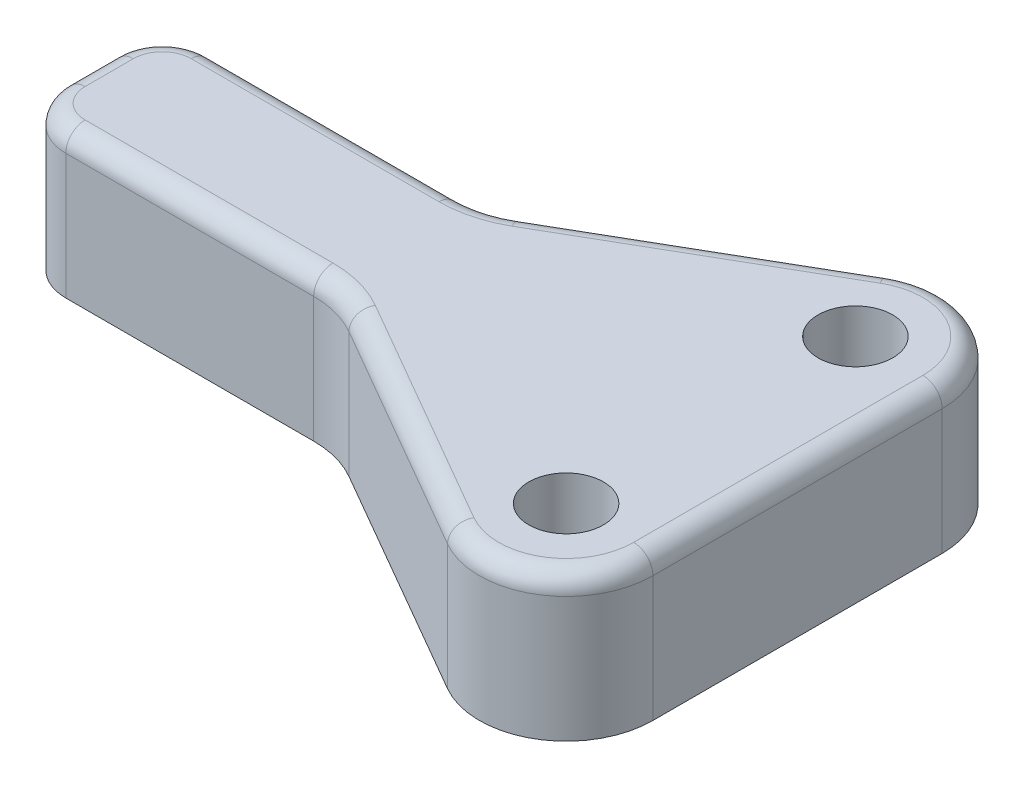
ISO-10303-21;
HEADER;
FILE_DESCRIPTION(('STEP AP214'),'2;1');
FILE_NAME('part.step','',(''),(''),'','','');
FILE_SCHEMA(('AUTOMOTIVE_DESIGN { 1 0 10303 214 1 1 1 1 }'));
ENDSEC;
DATA;
#1=APPLICATION_CONTEXT('core data for automotive mechanical design processes');
#2=APPLICATION_PROTOCOL_DEFINITION('international standard','automotive_design',2000,#1);
#3=PRODUCT_CONTEXT('',#1,'mechanical');
#4=PRODUCT('Part','Part','',(#3));
#5=PRODUCT_RELATED_PRODUCT_CATEGORY('part','',(#4));
#6=PRODUCT_DEFINITION_FORMATION('','',#4);
#7=PRODUCT_DEFINITION_CONTEXT('part definition',#1,'design');
#8=PRODUCT_DEFINITION('design','',#6,#7);
#9=PRODUCT_DEFINITION_SHAPE('','',#8);
#10=(LENGTH_UNIT() NAMED_UNIT(*) SI_UNIT(.MILLI.,.METRE.));
#11=(NAMED_UNIT(*) PLANE_ANGLE_UNIT() SI_UNIT($,.RADIAN.));
#12=(NAMED_UNIT(*) SI_UNIT($,.STERADIAN.) SOLID_ANGLE_UNIT());
#13=UNCERTAINTY_MEASURE_WITH_UNIT(LENGTH_MEASURE(1.E-05),#10,'distance_accuracy_value','');
#14=(GEOMETRIC_REPRESENTATION_CONTEXT(3) GLOBAL_UNCERTAINTY_ASSIGNED_CONTEXT((#13)) GLOBAL_UNIT_ASSIGNED_CONTEXT((#10,
#11,#12)) REPRESENTATION_CONTEXT('',''));
#15=CARTESIAN_POINT('',(0.,0.,0.));
#16=DIRECTION('',(0.,0.,1.));
#17=DIRECTION('',(1.,0.,0.));
#18=AXIS2_PLACEMENT_3D('',#15,#16,#17);
#19=CARTESIAN_POINT('',(40.6369769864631,-9.525,9.525));
#20=DIRECTION('',(0.,1.,0.));
#21=DIRECTION('',(0.,0.,1.));
#22=AXIS2_PLACEMENT_3D('',#19,#20,#21);
#23=CYLINDRICAL_SURFACE('',#22,5.715);
#24=DIRECTION('',(0.,1.,0.));
#25=VECTOR('',#24,1.);
#26=CARTESIAN_POINT('',(46.3519769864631,-9.525,9.525));
#27=LINE('',#26,#25);
#28=CARTESIAN_POINT('',(46.3519769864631,-9.525,9.525));
#29=VERTEX_POINT('',#28);
#30=CARTESIAN_POINT('',(46.3519769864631,-1.27,9.525));
#31=VERTEX_POINT('',#30);
#32=EDGE_CURVE('E241',#29,#31,#27,.T.);
#33=ORIENTED_EDGE('',*,*,#32,.T.);
#34=CARTESIAN_POINT('',(40.6369769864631,-1.27,9.525));
#35=DIRECTION('',(0.,-1.,0.));
#36=DIRECTION('',(0.,0.,-1.));
#37=AXIS2_PLACEMENT_3D('',#34,#35,#36);
#38=CIRCLE('',#37,5.715);
#39=CARTESIAN_POINT('',(37.7802549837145,-1.27,14.4747842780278));
#40=VERTEX_POINT('',#39);
#41=EDGE_CURVE('E316',#31,#40,#38,.T.);
#42=ORIENTED_EDGE('',*,*,#41,.T.);
#43=DIRECTION('',(0.,1.,0.));
#44=VECTOR('',#43,1.);
#45=CARTESIAN_POINT('',(37.7802549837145,-9.525,14.4747842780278));
#46=LINE('',#45,#44);
#47=CARTESIAN_POINT('',(37.7802549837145,-9.525,14.4747842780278));
#48=VERTEX_POINT('',#47);
#49=EDGE_CURVE('E242',#48,#40,#46,.T.);
#50=ORIENTED_EDGE('',*,*,#49,.F.);
#51=CARTESIAN_POINT('',(40.6369769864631,-9.525,9.525));
#52=DIRECTION('',(0.,1.,0.));
#53=DIRECTION('',(0.,0.,-1.));
#54=AXIS2_PLACEMENT_3D('',#51,#52,#53);
#55=CIRCLE('',#54,5.715);
#56=EDGE_CURVE('E205',#48,#29,#55,.T.);
#57=ORIENTED_EDGE('',*,*,#56,.T.);
#58=EDGE_LOOP('',(#33,#42,#50,#57));
#59=FACE_BOUND('',#58,.T.);
#60=ADVANCED_FACE('F51',(#59),#23,.T.);
#61=CARTESIAN_POINT('',(37.7802549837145,-9.525,14.4747842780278));
#62=DIRECTION('',(-0.49986386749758,0.,0.866103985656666));
#63=DIRECTION('',(0.866103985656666,0.,0.49986386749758));
#64=AXIS2_PLACEMENT_3D('',#61,#62,#63);
#65=PLANE('',#64);
#66=ORIENTED_EDGE('',*,*,#49,.T.);
#67=DIRECTION('',(0.866103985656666,0.,0.49986386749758));
#68=VECTOR('',#67,1.);
#69=CARTESIAN_POINT('',(22.4251700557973,-1.27,5.61273969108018));
#70=LINE('',#69,#68);
#71=CARTESIAN_POINT('',(22.4251700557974,-1.27,5.61273969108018));
#72=VERTEX_POINT('',#71);
#73=EDGE_CURVE('E75',#40,#72,#70,.F.);
#74=ORIENTED_EDGE('',*,*,#73,.T.);
#75=DIRECTION('',(0.,1.,0.));
#76=VECTOR('',#75,1.);
#77=CARTESIAN_POINT('',(22.4251700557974,-9.525,5.61273969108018));
#78=LINE('',#77,#76);
#79=CARTESIAN_POINT('',(22.4251700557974,-9.525,5.61273969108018));
#80=VERTEX_POINT('',#79);
#81=EDGE_CURVE('E245',#80,#72,#78,.T.);
#82=ORIENTED_EDGE('',*,*,#81,.F.);
#83=DIRECTION('',(0.866103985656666,0.,0.49986386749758));
#84=VECTOR('',#83,1.);
#85=CARTESIAN_POINT('',(37.7802549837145,-9.525,14.4747842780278));
#86=LINE('',#85,#84);
#87=EDGE_CURVE('E238',#80,#48,#86,.T.);
#88=ORIENTED_EDGE('',*,*,#87,.T.);
#89=EDGE_LOOP('',(#66,#74,#82,#88));
#90=FACE_BOUND('',#89,.T.);
#91=ADVANCED_FACE('F378',(#90),#65,.T.);
#92=CARTESIAN_POINT('',(19.2510344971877,-9.525,11.1125));
#93=DIRECTION('',(0.,1.,0.));
#94=DIRECTION('',(0.,0.,1.));
#95=AXIS2_PLACEMENT_3D('',#92,#93,#94);
#96=CYLINDRICAL_SURFACE('',#95,6.35);
#97=ORIENTED_EDGE('',*,*,#81,.T.);
#98=CARTESIAN_POINT('',(19.2510344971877,-1.27,11.1125));
#99=DIRECTION('',(0.,-1.,0.));
#100=DIRECTION('',(0.,0.,-1.));
#101=AXIS2_PLACEMENT_3D('',#98,#99,#100);
#102=CIRCLE('',#101,6.35);
#103=CARTESIAN_POINT('',(19.2510344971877,-1.27,4.76250000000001));
#104=VERTEX_POINT('',#103);
#105=EDGE_CURVE('E60',#72,#104,#102,.F.);
#106=ORIENTED_EDGE('',*,*,#105,.T.);
#107=DIRECTION('',(0.,1.,0.));
#108=VECTOR('',#107,1.);
#109=CARTESIAN_POINT('',(19.2510344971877,-9.525,4.76250000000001));
#110=LINE('',#109,#108);
#111=CARTESIAN_POINT('',(19.2510344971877,-9.525,4.76250000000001));
#112=VERTEX_POINT('',#111);
#113=EDGE_CURVE('E247',#112,#104,#110,.T.);
#114=ORIENTED_EDGE('',*,*,#113,.F.);
#115=CARTESIAN_POINT('',(19.2510344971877,-9.525,11.1125));
#116=DIRECTION('',(0.,-1.,0.));
#117=DIRECTION('',(0.,0.,1.));
#118=AXIS2_PLACEMENT_3D('',#115,#116,#117);
#119=CIRCLE('',#118,6.35);
#120=EDGE_CURVE('E235',#112,#80,#119,.T.);
#121=ORIENTED_EDGE('',*,*,#120,.T.);
#122=EDGE_LOOP('',(#97,#106,#114,#121));
#123=FACE_BOUND('',#122,.T.);
#124=ADVANCED_FACE('F453',(#123),#96,.F.);
#125=CARTESIAN_POINT('',(19.2510344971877,-9.525,4.76250000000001));
#126=DIRECTION('',(0.,0.,1.));
#127=DIRECTION('',(1.,0.,0.));
#128=AXIS2_PLACEMENT_3D('',#125,#126,#127);
#129=PLANE('',#128);
#130=ORIENTED_EDGE('',*,*,#113,.T.);
#131=DIRECTION('',(1.,0.,0.));
#132=VECTOR('',#131,1.);
#133=CARTESIAN_POINT('',(2.93013120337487,-1.27,4.76250000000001));
#134=LINE('',#133,#132);
#135=CARTESIAN_POINT('',(2.93013120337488,-1.27,4.76250000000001));
#136=VERTEX_POINT('',#135);
#137=EDGE_CURVE('E13',#104,#136,#134,.F.);
#138=ORIENTED_EDGE('',*,*,#137,.T.);
#139=DIRECTION('',(0.,1.,0.));
#140=VECTOR('',#139,1.);
#141=CARTESIAN_POINT('',(2.93013120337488,-9.525,4.76250000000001));
#142=LINE('',#141,#140);
#143=CARTESIAN_POINT('',(2.93013120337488,-9.525,4.76250000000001));
#144=VERTEX_POINT('',#143);
#145=EDGE_CURVE('E249',#144,#136,#142,.T.);
#146=ORIENTED_EDGE('',*,*,#145,.F.);
#147=DIRECTION('',(1.,0.,0.));
#148=VECTOR('',#147,1.);
#149=CARTESIAN_POINT('',(19.2510344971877,-9.525,4.76250000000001));
#150=LINE('',#149,#148);
#151=EDGE_CURVE('E232',#144,#112,#150,.T.);
#152=ORIENTED_EDGE('',*,*,#151,.T.);
#153=EDGE_LOOP('',(#130,#138,#146,#152));
#154=FACE_BOUND('',#153,.T.);
#155=ADVANCED_FACE('F396',(#154),#129,.T.);
#156=CARTESIAN_POINT('',(2.93013120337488,-9.525,1.58750000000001));
#157=DIRECTION('',(0.,1.,0.));
#158=DIRECTION('',(0.,0.,1.));
#159=AXIS2_PLACEMENT_3D('',#156,#157,#158);
#160=CYLINDRICAL_SURFACE('',#159,3.175);
#161=ORIENTED_EDGE('',*,*,#145,.T.);
#162=CARTESIAN_POINT('',(2.93013120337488,-1.27,1.58750000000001));
#163=DIRECTION('',(0.,-1.,0.));
#164=DIRECTION('',(0.,0.,-1.));
#165=AXIS2_PLACEMENT_3D('',#162,#163,#164);
#166=CIRCLE('',#165,3.175);
#167=CARTESIAN_POINT('',(-0.244868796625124,-1.27,1.58750000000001));
#168=VERTEX_POINT('',#167);
#169=EDGE_CURVE('E299',#136,#168,#166,.T.);
#170=ORIENTED_EDGE('',*,*,#169,.T.);
#171=DIRECTION('',(0.,1.,0.));
#172=VECTOR('',#171,1.);
#173=CARTESIAN_POINT('',(-0.244868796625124,-9.525,1.58750000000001));
#174=LINE('',#173,#172);
#175=CARTESIAN_POINT('',(-0.244868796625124,-9.525,1.58750000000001));
#176=VERTEX_POINT('',#175);
#177=EDGE_CURVE('E252',#176,#168,#174,.T.);
#178=ORIENTED_EDGE('',*,*,#177,.F.);
#179=CARTESIAN_POINT('',(2.93013120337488,-9.525,1.58750000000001));
#180=DIRECTION('',(0.,1.,0.));
#181=DIRECTION('',(0.,0.,-1.));
#182=AXIS2_PLACEMENT_3D('',#179,#180,#181);
#183=CIRCLE('',#182,3.175);
#184=EDGE_CURVE('E229',#176,#144,#183,.T.);
#185=ORIENTED_EDGE('',*,*,#184,.T.);
#186=EDGE_LOOP('',(#161,#170,#178,#185));
#187=FACE_BOUND('',#186,.T.);
#188=ADVANCED_FACE('F400',(#187),#160,.T.);
#189=CARTESIAN_POINT('',(-0.244868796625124,-9.525,1.58750000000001));
#190=DIRECTION('',(-1.,0.,0.));
#191=DIRECTION('',(0.,0.,1.));
#192=AXIS2_PLACEMENT_3D('',#189,#190,#191);
#193=PLANE('',#192);
#194=CARTESIAN_POINT('',(-0.244868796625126,-6.985,0.));
#195=DIRECTION('',(-1.,0.,0.));
#196=DIRECTION('',(0.,0.,1.));
#197=AXIS2_PLACEMENT_3D('',#194,#195,#196);
#198=CIRCLE('',#197,1.13029999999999);
#199=CARTESIAN_POINT('',(-0.244868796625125,-6.985,1.13029999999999));
#200=VERTEX_POINT('',#199);
#201=EDGE_CURVE('E189',#200,#200,#198,.T.);
#202=ORIENTED_EDGE('',*,*,#201,.F.);
#203=EDGE_LOOP('',(#202));
#204=FACE_BOUND('',#203,.T.);
#205=ORIENTED_EDGE('',*,*,#177,.T.);
#206=DIRECTION('',(0.,0.,1.));
#207=VECTOR('',#206,1.);
#208=CARTESIAN_POINT('',(-0.244868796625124,-1.27,-1.58749999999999));
#209=LINE('',#208,#207);
#210=CARTESIAN_POINT('',(-0.244868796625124,-1.27,-1.58749999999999));
#211=VERTEX_POINT('',#210);
#212=EDGE_CURVE('E302',#168,#211,#209,.F.);
#213=ORIENTED_EDGE('',*,*,#212,.T.);
#214=DIRECTION('',(0.,1.,0.));
#215=VECTOR('',#214,1.);
#216=CARTESIAN_POINT('',(-0.244868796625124,-9.525,-1.58749999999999));
#217=LINE('',#216,#215);
#218=CARTESIAN_POINT('',(-0.244868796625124,-9.525,-1.58749999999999));
#219=VERTEX_POINT('',#218);
#220=EDGE_CURVE('E255',#219,#211,#217,.T.);
#221=ORIENTED_EDGE('',*,*,#220,.F.);
#222=DIRECTION('',(0.,0.,1.));
#223=VECTOR('',#222,1.);
#224=CARTESIAN_POINT('',(-0.244868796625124,-9.525,1.58750000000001));
#225=LINE('',#224,#223);
#226=EDGE_CURVE('E226',#219,#176,#225,.T.);
#227=ORIENTED_EDGE('',*,*,#226,.T.);
#228=EDGE_LOOP('',(#205,#213,#221,#227));
#229=FACE_BOUND('',#228,.T.);
#230=ADVANCED_FACE('F412',(#204,#229),#193,.T.);
#231=CARTESIAN_POINT('',(2.93013120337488,-9.525,-1.58749999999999));
#232=DIRECTION('',(0.,1.,0.));
#233=DIRECTION('',(0.,0.,1.));
#234=AXIS2_PLACEMENT_3D('',#231,#232,#233);
#235=CYLINDRICAL_SURFACE('',#234,3.175);
#236=ORIENTED_EDGE('',*,*,#220,.T.);
#237=CARTESIAN_POINT('',(2.93013120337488,-1.27,-1.58749999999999));
#238=DIRECTION('',(0.,-1.,0.));
#239=DIRECTION('',(0.,0.,-1.));
#240=AXIS2_PLACEMENT_3D('',#237,#238,#239);
#241=CIRCLE('',#240,3.175);
#242=CARTESIAN_POINT('',(2.93013120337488,-1.27,-4.76249999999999));
#243=VERTEX_POINT('',#242);
#244=EDGE_CURVE('E304',#211,#243,#241,.T.);
#245=ORIENTED_EDGE('',*,*,#244,.T.);
#246=DIRECTION('',(0.,1.,0.));
#247=VECTOR('',#246,1.);
#248=CARTESIAN_POINT('',(2.93013120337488,-9.525,-4.76249999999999));
#249=LINE('',#248,#247);
#250=CARTESIAN_POINT('',(2.93013120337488,-9.525,-4.76249999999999));
#251=VERTEX_POINT('',#250);
#252=EDGE_CURVE('E258',#251,#243,#249,.T.);
#253=ORIENTED_EDGE('',*,*,#252,.F.);
#254=CARTESIAN_POINT('',(2.93013120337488,-9.525,-1.58749999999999));
#255=DIRECTION('',(0.,1.,0.));
#256=DIRECTION('',(0.,0.,1.));
#257=AXIS2_PLACEMENT_3D('',#254,#255,#256);
#258=CIRCLE('',#257,3.175);
#259=EDGE_CURVE('E223',#251,#219,#258,.T.);
#260=ORIENTED_EDGE('',*,*,#259,.T.);
#261=EDGE_LOOP('',(#236,#245,#253,#260));
#262=FACE_BOUND('',#261,.T.);
#263=ADVANCED_FACE('F416',(#262),#235,.T.);
#264=CARTESIAN_POINT('',(19.2510344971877,-9.525,-4.76249999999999));
#265=DIRECTION('',(0.,0.,-1.));
#266=DIRECTION('',(-1.,0.,0.));
#267=AXIS2_PLACEMENT_3D('',#264,#265,#266);
#268=PLANE('',#267);
#269=ORIENTED_EDGE('',*,*,#252,.T.);
#270=DIRECTION('',(-1.,0.,0.));
#271=VECTOR('',#270,1.);
#272=CARTESIAN_POINT('',(19.2510344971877,-1.27,-4.76249999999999));
#273=LINE('',#272,#271);
#274=CARTESIAN_POINT('',(19.2510344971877,-1.27,-4.76249999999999));
#275=VERTEX_POINT('',#274);
#276=EDGE_CURVE('E306',#243,#275,#273,.F.);
#277=ORIENTED_EDGE('',*,*,#276,.T.);
#278=DIRECTION('',(0.,1.,0.));
#279=VECTOR('',#278,1.);
#280=CARTESIAN_POINT('',(19.2510344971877,-9.525,-4.76249999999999));
#281=LINE('',#280,#279);
#282=CARTESIAN_POINT('',(19.2510344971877,-9.525,-4.76249999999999));
#283=VERTEX_POINT('',#282);
#284=EDGE_CURVE('E261',#283,#275,#281,.T.);
#285=ORIENTED_EDGE('',*,*,#284,.F.);
#286=DIRECTION('',(-1.,0.,0.));
#287=VECTOR('',#286,1.);
#288=CARTESIAN_POINT('',(19.2510344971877,-9.525,-4.76249999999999));
#289=LINE('',#288,#287);
#290=EDGE_CURVE('E220',#283,#251,#289,.T.);
#291=ORIENTED_EDGE('',*,*,#290,.T.);
#292=EDGE_LOOP('',(#269,#277,#285,#291));
#293=FACE_BOUND('',#292,.T.);
#294=ADVANCED_FACE('F428',(#293),#268,.T.);
#295=CARTESIAN_POINT('',(19.2510344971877,-9.525,-11.1125));
#296=DIRECTION('',(0.,1.,0.));
#297=DIRECTION('',(0.,0.,1.));
#298=AXIS2_PLACEMENT_3D('',#295,#296,#297);
#299=CYLINDRICAL_SURFACE('',#298,6.35);
#300=ORIENTED_EDGE('',*,*,#284,.T.);
#301=CARTESIAN_POINT('',(19.2510344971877,-1.27,-11.1125));
#302=DIRECTION('',(0.,-1.,0.));
#303=DIRECTION('',(0.,0.,-1.));
#304=AXIS2_PLACEMENT_3D('',#301,#302,#303);
#305=CIRCLE('',#304,6.35);
#306=CARTESIAN_POINT('',(22.4251700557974,-1.27,-5.61273969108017));
#307=VERTEX_POINT('',#306);
#308=EDGE_CURVE('E308',#275,#307,#305,.F.);
#309=ORIENTED_EDGE('',*,*,#308,.T.);
#310=DIRECTION('',(0.,1.,0.));
#311=VECTOR('',#310,1.);
#312=CARTESIAN_POINT('',(22.4251700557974,-9.525,-5.61273969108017));
#313=LINE('',#312,#311);
#314=CARTESIAN_POINT('',(22.4251700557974,-9.525,-5.61273969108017));
#315=VERTEX_POINT('',#314);
#316=EDGE_CURVE('E264',#315,#307,#313,.T.);
#317=ORIENTED_EDGE('',*,*,#316,.F.);
#318=CARTESIAN_POINT('',(19.2510344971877,-9.525,-11.1125));
#319=DIRECTION('',(0.,-1.,0.));
#320=DIRECTION('',(0.,0.,-1.));
#321=AXIS2_PLACEMENT_3D('',#318,#319,#320);
#322=CIRCLE('',#321,6.35);
#323=EDGE_CURVE('E217',#315,#283,#322,.T.);
#324=ORIENTED_EDGE('',*,*,#323,.T.);
#325=EDGE_LOOP('',(#300,#309,#317,#324));
#326=FACE_BOUND('',#325,.T.);
#327=ADVANCED_FACE('F432',(#326),#299,.F.);
#328=CARTESIAN_POINT('',(37.7802549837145,-9.525,-14.4747842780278));
#329=DIRECTION('',(-0.49986386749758,0.,-0.866103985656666));
#330=DIRECTION('',(-0.866103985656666,0.,0.49986386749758));
#331=AXIS2_PLACEMENT_3D('',#328,#329,#330);
#332=PLANE('',#331);
#333=ORIENTED_EDGE('',*,*,#316,.T.);
#334=DIRECTION('',(-0.866103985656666,0.,0.49986386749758));
#335=VECTOR('',#334,1.);
#336=CARTESIAN_POINT('',(37.7802549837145,-1.27,-14.4747842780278));
#337=LINE('',#336,#335);
#338=CARTESIAN_POINT('',(37.7802549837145,-1.27,-14.4747842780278));
#339=VERTEX_POINT('',#338);
#340=EDGE_CURVE('E310',#307,#339,#337,.F.);
#341=ORIENTED_EDGE('',*,*,#340,.T.);
#342=DIRECTION('',(0.,1.,0.));
#343=VECTOR('',#342,1.);
#344=CARTESIAN_POINT('',(37.7802549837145,-9.525,-14.4747842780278));
#345=LINE('',#344,#343);
#346=CARTESIAN_POINT('',(37.7802549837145,-9.525,-14.4747842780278));
#347=VERTEX_POINT('',#346);
#348=EDGE_CURVE('E267',#347,#339,#345,.T.);
#349=ORIENTED_EDGE('',*,*,#348,.F.);
#350=DIRECTION('',(-0.866103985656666,0.,0.49986386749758));
#351=VECTOR('',#350,1.);
#352=CARTESIAN_POINT('',(37.7802549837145,-9.525,-14.4747842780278));
#353=LINE('',#352,#351);
#354=EDGE_CURVE('E214',#347,#315,#353,.T.);
#355=ORIENTED_EDGE('',*,*,#354,.T.);
#356=EDGE_LOOP('',(#333,#341,#349,#355));
#357=FACE_BOUND('',#356,.T.);
#358=ADVANCED_FACE('F599',(#357),#332,.T.);
#359=CARTESIAN_POINT('',(40.6369769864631,-9.525,-9.525));
#360=DIRECTION('',(0.,1.,0.));
#361=DIRECTION('',(0.,0.,1.));
#362=AXIS2_PLACEMENT_3D('',#359,#360,#361);
#363=CYLINDRICAL_SURFACE('',#362,5.71499999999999);
#364=ORIENTED_EDGE('',*,*,#348,.T.);
#365=CARTESIAN_POINT('',(40.6369769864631,-1.27,-9.525));
#366=DIRECTION('',(0.,-1.,0.));
#367=DIRECTION('',(0.,0.,-1.));
#368=AXIS2_PLACEMENT_3D('',#365,#366,#367);
#369=CIRCLE('',#368,5.71499999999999);
#370=CARTESIAN_POINT('',(46.3519769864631,-1.27,-9.52499999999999));
#371=VERTEX_POINT('',#370);
#372=EDGE_CURVE('E312',#339,#371,#369,.T.);
#373=ORIENTED_EDGE('',*,*,#372,.T.);
#374=DIRECTION('',(0.,1.,0.));
#375=VECTOR('',#374,1.);
#376=CARTESIAN_POINT('',(46.3519769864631,-9.525,-9.52499999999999));
#377=LINE('',#376,#375);
#378=CARTESIAN_POINT('',(46.3519769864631,-9.525,-9.52499999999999));
#379=VERTEX_POINT('',#378);
#380=EDGE_CURVE('E270',#379,#371,#377,.T.);
#381=ORIENTED_EDGE('',*,*,#380,.F.);
#382=CARTESIAN_POINT('',(40.6369769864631,-9.525,-9.525));
#383=DIRECTION('',(0.,1.,0.));
#384=DIRECTION('',(0.,0.,1.));
#385=AXIS2_PLACEMENT_3D('',#382,#383,#384);
#386=CIRCLE('',#385,5.71499999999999);
#387=EDGE_CURVE('E211',#379,#347,#386,.T.);
#388=ORIENTED_EDGE('',*,*,#387,.T.);
#389=EDGE_LOOP('',(#364,#373,#381,#388));
#390=FACE_BOUND('',#389,.T.);
#391=ADVANCED_FACE('F364',(#390),#363,.T.);
#392=CARTESIAN_POINT('',(46.3519769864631,-9.525,-9.52499999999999));
#393=DIRECTION('',(1.,0.,0.));
#394=DIRECTION('',(0.,0.,-1.));
#395=AXIS2_PLACEMENT_3D('',#392,#393,#394);
#396=PLANE('',#395);
#397=ORIENTED_EDGE('',*,*,#380,.T.);
#398=DIRECTION('',(0.,0.,-1.));
#399=VECTOR('',#398,1.);
#400=CARTESIAN_POINT('',(46.3519769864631,-1.27,9.525));
#401=LINE('',#400,#399);
#402=EDGE_CURVE('E314',#371,#31,#401,.F.);
#403=ORIENTED_EDGE('',*,*,#402,.T.);
#404=ORIENTED_EDGE('',*,*,#32,.F.);
#405=DIRECTION('',(0.,0.,-1.));
#406=VECTOR('',#405,1.);
#407=CARTESIAN_POINT('',(46.3519769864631,-9.525,-9.52499999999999));
#408=LINE('',#407,#406);
#409=EDGE_CURVE('E208',#29,#379,#408,.T.);
#410=ORIENTED_EDGE('',*,*,#409,.T.);
#411=EDGE_LOOP('',(#397,#403,#404,#410));
#412=FACE_BOUND('',#411,.T.);
#413=ADVANCED_FACE('F367',(#412),#396,.T.);
#414=CARTESIAN_POINT('',(40.6369769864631,-9.525,9.525));
#415=DIRECTION('',(0.,-1.,0.));
#416=DIRECTION('',(0.,0.,-1.));
#417=AXIS2_PLACEMENT_3D('',#414,#415,#416);
#418=PLANE('',#417);
#419=CARTESIAN_POINT('',(40.6369769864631,-9.525,9.525));
#420=DIRECTION('',(0.,1.,0.));
#421=DIRECTION('',(0.,0.,1.));
#422=AXIS2_PLACEMENT_3D('',#419,#420,#421);
#423=CIRCLE('',#422,2.45745);
#424=CARTESIAN_POINT('',(40.6369769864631,-9.525,11.98245));
#425=VERTEX_POINT('',#424);
#426=EDGE_CURVE('E192',#425,#425,#423,.T.);
#427=ORIENTED_EDGE('',*,*,#426,.T.);
#428=EDGE_LOOP('',(#427));
#429=FACE_BOUND('',#428,.T.);
#430=CARTESIAN_POINT('',(40.6369769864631,-9.525,-9.525));
#431=DIRECTION('',(0.,1.,0.));
#432=DIRECTION('',(0.,0.,1.));
#433=AXIS2_PLACEMENT_3D('',#430,#431,#432);
#434=CIRCLE('',#433,2.45745);
#435=CARTESIAN_POINT('',(40.6369769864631,-9.525,-7.06755));
#436=VERTEX_POINT('',#435);
#437=EDGE_CURVE('E202',#436,#436,#434,.T.);
#438=ORIENTED_EDGE('',*,*,#437,.T.);
#439=EDGE_LOOP('',(#438));
#440=FACE_BOUND('',#439,.T.);
#441=ORIENTED_EDGE('',*,*,#56,.F.);
#442=ORIENTED_EDGE('',*,*,#87,.F.);
#443=ORIENTED_EDGE('',*,*,#120,.F.);
#444=ORIENTED_EDGE('',*,*,#151,.F.);
#445=ORIENTED_EDGE('',*,*,#184,.F.);
#446=ORIENTED_EDGE('',*,*,#226,.F.);
#447=ORIENTED_EDGE('',*,*,#259,.F.);
#448=ORIENTED_EDGE('',*,*,#290,.F.);
#449=ORIENTED_EDGE('',*,*,#323,.F.);
#450=ORIENTED_EDGE('',*,*,#354,.F.);
#451=ORIENTED_EDGE('',*,*,#387,.F.);
#452=ORIENTED_EDGE('',*,*,#409,.F.);
#453=EDGE_LOOP('',(#441,#442,#443,#444,#445,#446,#447,#448,#449,#450,#451,#452));
#454=FACE_BOUND('',#453,.T.);
#455=ADVANCED_FACE('F371',(#429,#440,#454),#418,.T.);
#456=CARTESIAN_POINT('',(40.6369769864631,0.,9.525));
#457=DIRECTION('',(0.,-1.,0.));
#458=DIRECTION('',(0.,0.,-1.));
#459=AXIS2_PLACEMENT_3D('',#456,#457,#458);
#460=PLANE('',#459);
#461=DIRECTION('',(0.,0.,1.));
#462=VECTOR('',#461,1.);
#463=CARTESIAN_POINT('',(1.02513120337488,0.,1.58750000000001));
#464=LINE('',#463,#462);
#465=CARTESIAN_POINT('',(1.02513120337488,0.,-1.58749999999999));
#466=VERTEX_POINT('',#465);
#467=CARTESIAN_POINT('',(1.02513120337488,0.,1.58750000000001));
#468=VERTEX_POINT('',#467);
#469=EDGE_CURVE('E294',#466,#468,#464,.T.);
#470=ORIENTED_EDGE('',*,*,#469,.T.);
#471=CARTESIAN_POINT('',(2.93013120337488,0.,1.58750000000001));
#472=DIRECTION('',(0.,-1.,0.));
#473=DIRECTION('',(0.,0.,-1.));
#474=AXIS2_PLACEMENT_3D('',#471,#472,#473);
#475=CIRCLE('',#474,1.905);
#476=CARTESIAN_POINT('',(2.93013120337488,0.,3.49250000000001));
#477=VERTEX_POINT('',#476);
#478=EDGE_CURVE('E296',#468,#477,#475,.F.);
#479=ORIENTED_EDGE('',*,*,#478,.T.);
#480=DIRECTION('',(1.,0.,0.));
#481=VECTOR('',#480,1.);
#482=CARTESIAN_POINT('',(19.2510344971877,0.,3.49250000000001));
#483=LINE('',#482,#481);
#484=CARTESIAN_POINT('',(19.2510344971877,0.,3.49250000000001));
#485=VERTEX_POINT('',#484);
#486=EDGE_CURVE('E244',#477,#485,#483,.T.);
#487=ORIENTED_EDGE('',*,*,#486,.T.);
#488=CARTESIAN_POINT('',(19.2510344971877,0.,11.1125));
#489=DIRECTION('',(0.,-1.,0.));
#490=DIRECTION('',(0.,0.,-1.));
#491=AXIS2_PLACEMENT_3D('',#488,#489,#490);
#492=CIRCLE('',#491,7.62);
#493=CARTESIAN_POINT('',(23.0599971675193,0.,4.51278762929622));
#494=VERTEX_POINT('',#493);
#495=EDGE_CURVE('E276',#485,#494,#492,.T.);
#496=ORIENTED_EDGE('',*,*,#495,.T.);
#497=DIRECTION('',(0.866103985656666,0.,0.49986386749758));
#498=VECTOR('',#497,1.);
#499=CARTESIAN_POINT('',(38.4150820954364,0.,13.3748322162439));
#500=LINE('',#499,#498);
#501=CARTESIAN_POINT('',(38.4150820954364,0.,13.3748322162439));
#502=VERTEX_POINT('',#501);
#503=EDGE_CURVE('E278',#494,#502,#500,.T.);
#504=ORIENTED_EDGE('',*,*,#503,.T.);
#505=CARTESIAN_POINT('',(40.6369769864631,0.,9.525));
#506=DIRECTION('',(0.,-1.,0.));
#507=DIRECTION('',(0.,0.,-1.));
#508=AXIS2_PLACEMENT_3D('',#505,#506,#507);
#509=CIRCLE('',#508,4.445);
#510=CARTESIAN_POINT('',(45.0819769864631,0.,9.525));
#511=VERTEX_POINT('',#510);
#512=EDGE_CURVE('E280',#502,#511,#509,.F.);
#513=ORIENTED_EDGE('',*,*,#512,.T.);
#514=DIRECTION('',(0.,0.,-1.));
#515=VECTOR('',#514,1.);
#516=CARTESIAN_POINT('',(45.0819769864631,0.,-9.52499999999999));
#517=LINE('',#516,#515);
#518=CARTESIAN_POINT('',(45.0819769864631,0.,-9.52499999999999));
#519=VERTEX_POINT('',#518);
#520=EDGE_CURVE('E282',#511,#519,#517,.T.);
#521=ORIENTED_EDGE('',*,*,#520,.T.);
#522=CARTESIAN_POINT('',(40.6369769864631,0.,-9.525));
#523=DIRECTION('',(0.,-1.,0.));
#524=DIRECTION('',(0.,0.,-1.));
#525=AXIS2_PLACEMENT_3D('',#522,#523,#524);
#526=CIRCLE('',#525,4.44499999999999);
#527=CARTESIAN_POINT('',(38.4150820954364,0.,-13.3748322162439));
#528=VERTEX_POINT('',#527);
#529=EDGE_CURVE('E284',#519,#528,#526,.F.);
#530=ORIENTED_EDGE('',*,*,#529,.T.);
#531=DIRECTION('',(-0.866103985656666,0.,0.49986386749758));
#532=VECTOR('',#531,1.);
#533=CARTESIAN_POINT('',(23.0599971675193,0.,-4.5127876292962));
#534=LINE('',#533,#532);
#535=CARTESIAN_POINT('',(23.0599971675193,0.,-4.5127876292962));
#536=VERTEX_POINT('',#535);
#537=EDGE_CURVE('E286',#528,#536,#534,.T.);
#538=ORIENTED_EDGE('',*,*,#537,.T.);
#539=CARTESIAN_POINT('',(19.2510344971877,0.,-11.1125));
#540=DIRECTION('',(0.,-1.,0.));
#541=DIRECTION('',(0.,0.,-1.));
#542=AXIS2_PLACEMENT_3D('',#539,#540,#541);
#543=CIRCLE('',#542,7.62);
#544=CARTESIAN_POINT('',(19.2510344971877,0.,-3.49249999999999));
#545=VERTEX_POINT('',#544);
#546=EDGE_CURVE('E288',#536,#545,#543,.T.);
#547=ORIENTED_EDGE('',*,*,#546,.T.);
#548=DIRECTION('',(-1.,0.,0.));
#549=VECTOR('',#548,1.);
#550=CARTESIAN_POINT('',(2.93013120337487,0.,-3.49249999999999));
#551=LINE('',#550,#549);
#552=CARTESIAN_POINT('',(2.93013120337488,0.,-3.49249999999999));
#553=VERTEX_POINT('',#552);
#554=EDGE_CURVE('E290',#545,#553,#551,.T.);
#555=ORIENTED_EDGE('',*,*,#554,.T.);
#556=CARTESIAN_POINT('',(2.93013120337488,0.,-1.58749999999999));
#557=DIRECTION('',(0.,-1.,0.));
#558=DIRECTION('',(0.,0.,-1.));
#559=AXIS2_PLACEMENT_3D('',#556,#557,#558);
#560=CIRCLE('',#559,1.905);
#561=EDGE_CURVE('E292',#553,#466,#560,.F.);
#562=ORIENTED_EDGE('',*,*,#561,.T.);
#563=EDGE_LOOP('',(#470,#479,#487,#496,#504,#513,#521,#530,#538,#547,#555,#562));
#564=FACE_BOUND('',#563,.T.);
#565=CARTESIAN_POINT('',(40.6369769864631,0.,9.525));
#566=DIRECTION('',(0.,1.,0.));
#567=DIRECTION('',(0.,0.,1.));
#568=AXIS2_PLACEMENT_3D('',#565,#566,#567);
#569=CIRCLE('',#568,2.45745);
#570=CARTESIAN_POINT('',(40.6369769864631,0.,11.98245));
#571=VERTEX_POINT('',#570);
#572=EDGE_CURVE('E188',#571,#571,#569,.T.);
#573=ORIENTED_EDGE('',*,*,#572,.F.);
#574=EDGE_LOOP('',(#573));
#575=FACE_BOUND('',#574,.T.);
#576=CARTESIAN_POINT('',(40.6369769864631,0.,-9.525));
#577=DIRECTION('',(0.,1.,0.));
#578=DIRECTION('',(0.,0.,1.));
#579=AXIS2_PLACEMENT_3D('',#576,#577,#578);
#580=CIRCLE('',#579,2.45745);
#581=CARTESIAN_POINT('',(40.6369769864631,0.,-7.06755));
#582=VERTEX_POINT('',#581);
#583=EDGE_CURVE('E199',#582,#582,#580,.T.);
#584=ORIENTED_EDGE('',*,*,#583,.F.);
#585=EDGE_LOOP('',(#584));
#586=FACE_BOUND('',#585,.T.);
#587=ADVANCED_FACE('F438',(#564,#575,#586),#460,.F.);
#588=CARTESIAN_POINT('',(40.6369769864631,0.,-9.525));
#589=DIRECTION('',(0.,1.,0.));
#590=DIRECTION('',(0.,0.,1.));
#591=AXIS2_PLACEMENT_3D('',#588,#589,#590);
#592=CYLINDRICAL_SURFACE('',#591,2.45745);
#593=ORIENTED_EDGE('',*,*,#437,.F.);
#594=EDGE_LOOP('',(#593));
#595=FACE_BOUND('',#594,.T.);
#596=ORIENTED_EDGE('',*,*,#583,.T.);
#597=EDGE_LOOP('',(#596));
#598=FACE_BOUND('',#597,.T.);
#599=ADVANCED_FACE('F562',(#595,#598),#592,.F.);
#600=CARTESIAN_POINT('',(40.6369769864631,0.,9.525));
#601=DIRECTION('',(0.,1.,0.));
#602=DIRECTION('',(0.,0.,1.));
#603=AXIS2_PLACEMENT_3D('',#600,#601,#602);
#604=CYLINDRICAL_SURFACE('',#603,2.45745);
#605=ORIENTED_EDGE('',*,*,#426,.F.);
#606=EDGE_LOOP('',(#605));
#607=FACE_BOUND('',#606,.T.);
#608=ORIENTED_EDGE('',*,*,#572,.T.);
#609=EDGE_LOOP('',(#608));
#610=FACE_BOUND('',#609,.T.);
#611=ADVANCED_FACE('F182',(#607,#610),#604,.F.);
#612=CARTESIAN_POINT('',(12.4551312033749,-6.985,0.));
#613=DIRECTION('',(-1.,0.,0.));
#614=DIRECTION('',(0.,0.,1.));
#615=AXIS2_PLACEMENT_3D('',#612,#613,#614);
#616=CONICAL_SURFACE('',#615,1.1303,1.02974425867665);
#617=CARTESIAN_POINT('',(13.1342839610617,-6.985,0.));
#618=VERTEX_POINT('',#617);
#619=VERTEX_LOOP('',#618);
#620=FACE_BOUND('',#619,.T.);
#621=CARTESIAN_POINT('',(12.4551312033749,-6.985,0.));
#622=DIRECTION('',(-1.,0.,0.));
#623=DIRECTION('',(0.,0.,1.));
#624=AXIS2_PLACEMENT_3D('',#621,#622,#623);
#625=CIRCLE('',#624,1.1303);
#626=CARTESIAN_POINT('',(12.4551312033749,-6.985,1.1303));
#627=VERTEX_POINT('',#626);
#628=EDGE_CURVE('E186',#627,#627,#625,.T.);
#629=ORIENTED_EDGE('',*,*,#628,.T.);
#630=EDGE_LOOP('',(#629));
#631=FACE_BOUND('',#630,.T.);
#632=ADVANCED_FACE('F178',(#620,#631),#616,.F.);
#633=CARTESIAN_POINT('',(-0.244868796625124,-6.985,0.));
#634=DIRECTION('',(-1.,0.,0.));
#635=DIRECTION('',(0.,0.,1.));
#636=AXIS2_PLACEMENT_3D('',#633,#634,#635);
#637=CYLINDRICAL_SURFACE('',#636,1.13029999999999);
#638=ORIENTED_EDGE('',*,*,#628,.F.);
#639=EDGE_LOOP('',(#638));
#640=FACE_BOUND('',#639,.T.);
#641=ORIENTED_EDGE('',*,*,#201,.T.);
#642=EDGE_LOOP('',(#641));
#643=FACE_BOUND('',#642,.T.);
#644=ADVANCED_FACE('F181',(#640,#643),#637,.F.);
#645=CARTESIAN_POINT('',(40.6369769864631,-1.27,-9.525));
#646=DIRECTION('',(0.,-1.,0.));
#647=DIRECTION('',(0.,0.,-1.));
#648=AXIS2_PLACEMENT_3D('',#645,#646,#647);
#649=TOROIDAL_SURFACE('',#648,4.44499999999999,1.27);
#650=CARTESIAN_POINT('',(45.0819769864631,-1.27,-9.52499999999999));
#651=DIRECTION('',(0.,0.,1.));
#652=DIRECTION('',(1.,0.,0.));
#653=AXIS2_PLACEMENT_3D('',#650,#651,#652);
#654=CIRCLE('',#653,1.27);
#655=EDGE_CURVE('E347',#371,#519,#654,.T.);
#656=ORIENTED_EDGE('',*,*,#655,.F.);
#657=ORIENTED_EDGE('',*,*,#372,.F.);
#658=CARTESIAN_POINT('',(38.4150820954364,-1.27,-13.3748322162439));
#659=DIRECTION('',(-0.866103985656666,0.,0.49986386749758));
#660=DIRECTION('',(0.49986386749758,0.,0.866103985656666));
#661=AXIS2_PLACEMENT_3D('',#658,#659,#660);
#662=CIRCLE('',#661,1.27);
#663=EDGE_CURVE('E55',#528,#339,#662,.T.);
#664=ORIENTED_EDGE('',*,*,#663,.F.);
#665=ORIENTED_EDGE('',*,*,#529,.F.);
#666=EDGE_LOOP('',(#656,#657,#664,#665));
#667=FACE_BOUND('',#666,.T.);
#668=ADVANCED_FACE('F53',(#667),#649,.T.);
#669=CARTESIAN_POINT('',(30.1676877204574,-1.27,-8.61492518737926));
#670=DIRECTION('',(0.866103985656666,0.,-0.49986386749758));
#671=DIRECTION('',(-0.49986386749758,0.,-0.866103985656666));
#672=AXIS2_PLACEMENT_3D('',#669,#670,#671);
#673=CYLINDRICAL_SURFACE('',#672,1.27);
#674=ORIENTED_EDGE('',*,*,#663,.T.);
#675=ORIENTED_EDGE('',*,*,#340,.F.);
#676=CARTESIAN_POINT('',(23.0599971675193,-1.27,-4.5127876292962));
#677=DIRECTION('',(-0.866103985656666,0.,0.499863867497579));
#678=DIRECTION('',(0.499863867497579,0.,0.866103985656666));
#679=AXIS2_PLACEMENT_3D('',#676,#677,#678);
#680=CIRCLE('',#679,1.27);
#681=EDGE_CURVE('E345',#536,#307,#680,.T.);
#682=ORIENTED_EDGE('',*,*,#681,.F.);
#683=ORIENTED_EDGE('',*,*,#537,.F.);
#684=EDGE_LOOP('',(#674,#675,#682,#683));
#685=FACE_BOUND('',#684,.T.);
#686=ADVANCED_FACE('F358',(#685),#673,.T.);
#687=CARTESIAN_POINT('',(45.0819769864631,-1.27,9.525));
#688=DIRECTION('',(0.,0.,1.));
#689=DIRECTION('',(1.,0.,0.));
#690=AXIS2_PLACEMENT_3D('',#687,#688,#689);
#691=CYLINDRICAL_SURFACE('',#690,1.27);
#692=ORIENTED_EDGE('',*,*,#655,.T.);
#693=ORIENTED_EDGE('',*,*,#520,.F.);
#694=CARTESIAN_POINT('',(45.0819769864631,-1.27,9.525));
#695=DIRECTION('',(0.,0.,1.));
#696=DIRECTION('',(1.,0.,0.));
#697=AXIS2_PLACEMENT_3D('',#694,#695,#696);
#698=CIRCLE('',#697,1.27);
#699=EDGE_CURVE('E342',#31,#511,#698,.T.);
#700=ORIENTED_EDGE('',*,*,#699,.F.);
#701=ORIENTED_EDGE('',*,*,#402,.F.);
#702=EDGE_LOOP('',(#692,#693,#700,#701));
#703=FACE_BOUND('',#702,.T.);
#704=ADVANCED_FACE('F440',(#703),#691,.T.);
#705=CARTESIAN_POINT('',(19.2510344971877,-1.27,-11.1125));
#706=DIRECTION('',(0.,-1.,0.));
#707=DIRECTION('',(0.,0.,-1.));
#708=AXIS2_PLACEMENT_3D('',#705,#706,#707);
#709=TOROIDAL_SURFACE('',#708,7.62,1.27);
#710=ORIENTED_EDGE('',*,*,#681,.T.);
#711=ORIENTED_EDGE('',*,*,#308,.F.);
#712=CARTESIAN_POINT('',(19.2510344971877,-1.27,-3.49249999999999));
#713=DIRECTION('',(-1.,0.,0.));
#714=DIRECTION('',(0.,0.,1.));
#715=AXIS2_PLACEMENT_3D('',#712,#713,#714);
#716=CIRCLE('',#715,1.27);
#717=EDGE_CURVE('E339',#545,#275,#716,.T.);
#718=ORIENTED_EDGE('',*,*,#717,.F.);
#719=ORIENTED_EDGE('',*,*,#546,.F.);
#720=EDGE_LOOP('',(#710,#711,#718,#719));
#721=FACE_BOUND('',#720,.T.);
#722=ADVANCED_FACE('F435',(#721),#709,.T.);
#723=CARTESIAN_POINT('',(40.6369769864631,-1.27,9.525));
#724=DIRECTION('',(0.,-1.,0.));
#725=DIRECTION('',(0.,0.,-1.));
#726=AXIS2_PLACEMENT_3D('',#723,#724,#725);
#727=TOROIDAL_SURFACE('',#726,4.445,1.27);
#728=ORIENTED_EDGE('',*,*,#699,.T.);
#729=ORIENTED_EDGE('',*,*,#512,.F.);
#730=CARTESIAN_POINT('',(38.4150820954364,-1.27,13.3748322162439));
#731=DIRECTION('',(-0.866103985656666,0.,-0.49986386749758));
#732=DIRECTION('',(-0.49986386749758,0.,0.866103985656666));
#733=AXIS2_PLACEMENT_3D('',#730,#731,#732);
#734=CIRCLE('',#733,1.27);
#735=EDGE_CURVE('E336',#40,#502,#734,.T.);
#736=ORIENTED_EDGE('',*,*,#735,.F.);
#737=ORIENTED_EDGE('',*,*,#41,.F.);
#738=EDGE_LOOP('',(#728,#729,#736,#737));
#739=FACE_BOUND('',#738,.T.);
#740=ADVANCED_FACE('F381',(#739),#727,.T.);
#741=CARTESIAN_POINT('',(40.6369769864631,-1.27,-3.49249999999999));
#742=DIRECTION('',(1.,0.,0.));
#743=DIRECTION('',(0.,0.,-1.));
#744=AXIS2_PLACEMENT_3D('',#741,#742,#743);
#745=CYLINDRICAL_SURFACE('',#744,1.27);
#746=ORIENTED_EDGE('',*,*,#717,.T.);
#747=ORIENTED_EDGE('',*,*,#276,.F.);
#748=CARTESIAN_POINT('',(2.93013120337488,-1.27,-3.49249999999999));
#749=DIRECTION('',(-1.,0.,0.));
#750=DIRECTION('',(0.,0.,1.));
#751=AXIS2_PLACEMENT_3D('',#748,#749,#750);
#752=CIRCLE('',#751,1.27);
#753=EDGE_CURVE('E333',#553,#243,#752,.T.);
#754=ORIENTED_EDGE('',*,*,#753,.F.);
#755=ORIENTED_EDGE('',*,*,#554,.F.);
#756=EDGE_LOOP('',(#746,#747,#754,#755));
#757=FACE_BOUND('',#756,.T.);
#758=ADVANCED_FACE('F425',(#757),#745,.T.);
#759=CARTESIAN_POINT('',(38.4150820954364,-1.27,13.3748322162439));
#760=DIRECTION('',(-0.866103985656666,0.,-0.49986386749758));
#761=DIRECTION('',(-0.49986386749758,0.,0.866103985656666));
#762=AXIS2_PLACEMENT_3D('',#759,#760,#761);
#763=CYLINDRICAL_SURFACE('',#762,1.27);
#764=ORIENTED_EDGE('',*,*,#735,.T.);
#765=ORIENTED_EDGE('',*,*,#503,.F.);
#766=CARTESIAN_POINT('',(23.0599971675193,-1.27,4.51278762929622));
#767=DIRECTION('',(-0.866103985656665,0.,-0.499863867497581));
#768=DIRECTION('',(-0.499863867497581,0.,0.866103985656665));
#769=AXIS2_PLACEMENT_3D('',#766,#767,#768);
#770=CIRCLE('',#769,1.27);
#771=EDGE_CURVE('E330',#72,#494,#770,.T.);
#772=ORIENTED_EDGE('',*,*,#771,.F.);
#773=ORIENTED_EDGE('',*,*,#73,.F.);
#774=EDGE_LOOP('',(#764,#765,#772,#773));
#775=FACE_BOUND('',#774,.T.);
#776=ADVANCED_FACE('F385',(#775),#763,.T.);
#777=CARTESIAN_POINT('',(2.93013120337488,-1.27,-1.58749999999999));
#778=DIRECTION('',(0.,-1.,0.));
#779=DIRECTION('',(0.,0.,-1.));
#780=AXIS2_PLACEMENT_3D('',#777,#778,#779);
#781=TOROIDAL_SURFACE('',#780,1.905,1.27);
#782=ORIENTED_EDGE('',*,*,#753,.T.);
#783=ORIENTED_EDGE('',*,*,#244,.F.);
#784=CARTESIAN_POINT('',(1.02513120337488,-1.27,-1.58749999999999));
#785=DIRECTION('',(0.,0.,1.));
#786=DIRECTION('',(1.,0.,0.));
#787=AXIS2_PLACEMENT_3D('',#784,#785,#786);
#788=CIRCLE('',#787,1.27);
#789=EDGE_CURVE('E327',#466,#211,#788,.T.);
#790=ORIENTED_EDGE('',*,*,#789,.F.);
#791=ORIENTED_EDGE('',*,*,#561,.F.);
#792=EDGE_LOOP('',(#782,#783,#790,#791));
#793=FACE_BOUND('',#792,.T.);
#794=ADVANCED_FACE('F419',(#793),#781,.T.);
#795=CARTESIAN_POINT('',(19.2510344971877,-1.27,11.1125));
#796=DIRECTION('',(0.,-1.,0.));
#797=DIRECTION('',(0.,0.,-1.));
#798=AXIS2_PLACEMENT_3D('',#795,#796,#797);
#799=TOROIDAL_SURFACE('',#798,7.62,1.27);
#800=ORIENTED_EDGE('',*,*,#771,.T.);
#801=ORIENTED_EDGE('',*,*,#495,.F.);
#802=CARTESIAN_POINT('',(19.2510344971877,-1.27,3.49250000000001));
#803=DIRECTION('',(-1.,0.,0.));
#804=DIRECTION('',(0.,0.,1.));
#805=AXIS2_PLACEMENT_3D('',#802,#803,#804);
#806=CIRCLE('',#805,1.27);
#807=EDGE_CURVE('E324',#104,#485,#806,.T.);
#808=ORIENTED_EDGE('',*,*,#807,.F.);
#809=ORIENTED_EDGE('',*,*,#105,.F.);
#810=EDGE_LOOP('',(#800,#801,#808,#809));
#811=FACE_BOUND('',#810,.T.);
#812=ADVANCED_FACE('F389',(#811),#799,.T.);
#813=CARTESIAN_POINT('',(1.02513120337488,-1.27,9.525));
#814=DIRECTION('',(0.,0.,-1.));
#815=DIRECTION('',(-1.,0.,0.));
#816=AXIS2_PLACEMENT_3D('',#813,#814,#815);
#817=CYLINDRICAL_SURFACE('',#816,1.27);
#818=ORIENTED_EDGE('',*,*,#789,.T.);
#819=ORIENTED_EDGE('',*,*,#212,.F.);
#820=CARTESIAN_POINT('',(1.02513120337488,-1.27,1.58750000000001));
#821=DIRECTION('',(0.,0.,1.));
#822=DIRECTION('',(1.,0.,0.));
#823=AXIS2_PLACEMENT_3D('',#820,#821,#822);
#824=CIRCLE('',#823,1.27);
#825=EDGE_CURVE('E322',#468,#168,#824,.T.);
#826=ORIENTED_EDGE('',*,*,#825,.F.);
#827=ORIENTED_EDGE('',*,*,#469,.F.);
#828=EDGE_LOOP('',(#818,#819,#826,#827));
#829=FACE_BOUND('',#828,.T.);
#830=ADVANCED_FACE('F409',(#829),#817,.T.);
#831=CARTESIAN_POINT('',(40.6369769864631,-1.27,3.49250000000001));
#832=DIRECTION('',(-1.,0.,0.));
#833=DIRECTION('',(0.,0.,1.));
#834=AXIS2_PLACEMENT_3D('',#831,#832,#833);
#835=CYLINDRICAL_SURFACE('',#834,1.27);
#836=ORIENTED_EDGE('',*,*,#807,.T.);
#837=ORIENTED_EDGE('',*,*,#486,.F.);
#838=CARTESIAN_POINT('',(2.93013120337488,-1.27,3.49250000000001));
#839=DIRECTION('',(-1.,0.,0.));
#840=DIRECTION('',(0.,0.,1.));
#841=AXIS2_PLACEMENT_3D('',#838,#839,#840);
#842=CIRCLE('',#841,1.27);
#843=EDGE_CURVE('E320',#136,#477,#842,.T.);
#844=ORIENTED_EDGE('',*,*,#843,.F.);
#845=ORIENTED_EDGE('',*,*,#137,.F.);
#846=EDGE_LOOP('',(#836,#837,#844,#845));
#847=FACE_BOUND('',#846,.T.);
#848=ADVANCED_FACE('F394',(#847),#835,.T.);
#849=CARTESIAN_POINT('',(2.93013120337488,-1.27,1.58750000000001));
#850=DIRECTION('',(0.,-1.,0.));
#851=DIRECTION('',(0.,0.,-1.));
#852=AXIS2_PLACEMENT_3D('',#849,#850,#851);
#853=TOROIDAL_SURFACE('',#852,1.905,1.27);
#854=ORIENTED_EDGE('',*,*,#825,.T.);
#855=ORIENTED_EDGE('',*,*,#169,.F.);
#856=ORIENTED_EDGE('',*,*,#843,.T.);
#857=ORIENTED_EDGE('',*,*,#478,.F.);
#858=EDGE_LOOP('',(#854,#855,#856,#857));
#859=FACE_BOUND('',#858,.T.);
#860=ADVANCED_FACE('F403',(#859),#853,.T.);
#861=CLOSED_SHELL('',(#60,#91,#124,#155,#188,#230,#263,#294,#327,#358,#391,#413,#455,#587,#599,
#611,#632,#644,#668,#686,#704,#722,#740,#758,#776,#794,#812,#830,#848,#860));
#862=MANIFOLD_SOLID_BREP('B2',#861);
#863=ADVANCED_BREP_SHAPE_REPRESENTATION('',(#18,#862),#14);
#864=SHAPE_DEFINITION_REPRESENTATION(#9,#863);
ENDSEC;
END-ISO-10303-21;
